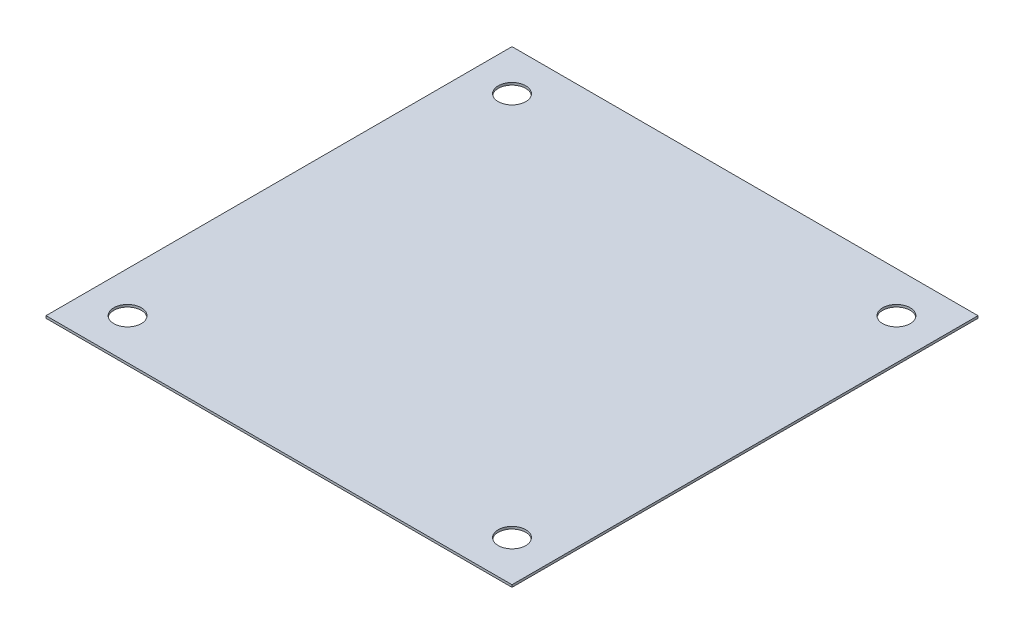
ISO-10303-21;
HEADER;
FILE_DESCRIPTION(('STEP AP214'),'2;1');
FILE_NAME('part.step','',(''),(''),'','','');
FILE_SCHEMA(('AUTOMOTIVE_DESIGN { 1 0 10303 214 1 1 1 1 }'));
ENDSEC;
DATA;
#1=APPLICATION_CONTEXT('core data for automotive mechanical design processes');
#2=APPLICATION_PROTOCOL_DEFINITION('international standard','automotive_design',2000,#1);
#3=PRODUCT_CONTEXT('',#1,'mechanical');
#4=PRODUCT('Part','Part','',(#3));
#5=PRODUCT_RELATED_PRODUCT_CATEGORY('part','',(#4));
#6=PRODUCT_DEFINITION_FORMATION('','',#4);
#7=PRODUCT_DEFINITION_CONTEXT('part definition',#1,'design');
#8=PRODUCT_DEFINITION('design','',#6,#7);
#9=PRODUCT_DEFINITION_SHAPE('','',#8);
#10=(LENGTH_UNIT() NAMED_UNIT(*) SI_UNIT(.MILLI.,.METRE.));
#11=(NAMED_UNIT(*) PLANE_ANGLE_UNIT() SI_UNIT($,.RADIAN.));
#12=(NAMED_UNIT(*) SI_UNIT($,.STERADIAN.) SOLID_ANGLE_UNIT());
#13=UNCERTAINTY_MEASURE_WITH_UNIT(LENGTH_MEASURE(1.E-05),#10,'distance_accuracy_value','');
#14=(GEOMETRIC_REPRESENTATION_CONTEXT(3) GLOBAL_UNCERTAINTY_ASSIGNED_CONTEXT((#13)) GLOBAL_UNIT_ASSIGNED_CONTEXT((#10,
#11,#12)) REPRESENTATION_CONTEXT('',''));
#15=CARTESIAN_POINT('',(0.,0.,0.));
#16=DIRECTION('',(0.,0.,1.));
#17=DIRECTION('',(1.,0.,0.));
#18=AXIS2_PLACEMENT_3D('',#15,#16,#17);
#19=CARTESIAN_POINT('',(-25.4,2.54,0.));
#20=DIRECTION('',(-1.,0.,0.));
#21=DIRECTION('',(0.,0.,1.));
#22=AXIS2_PLACEMENT_3D('',#19,#20,#21);
#23=PLANE('',#22);
#24=DIRECTION('',(0.,1.,0.));
#25=VECTOR('',#24,1.);
#26=CARTESIAN_POINT('',(-25.4,2.54,-25.4));
#27=LINE('',#26,#25);
#28=CARTESIAN_POINT('',(-25.4,2.413,-25.4));
#29=VERTEX_POINT('',#28);
#30=CARTESIAN_POINT('',(-25.4,2.667,-25.4));
#31=VERTEX_POINT('',#30);
#32=EDGE_CURVE('E11',#29,#31,#27,.T.);
#33=ORIENTED_EDGE('',*,*,#32,.F.);
#34=DIRECTION('',(0.,0.,1.));
#35=VECTOR('',#34,1.);
#36=CARTESIAN_POINT('',(-25.4,2.413,0.));
#37=LINE('',#36,#35);
#38=CARTESIAN_POINT('',(-25.4,2.413,25.4));
#39=VERTEX_POINT('',#38);
#40=EDGE_CURVE('E94',#39,#29,#37,.F.);
#41=ORIENTED_EDGE('',*,*,#40,.F.);
#42=DIRECTION('',(0.,1.,0.));
#43=VECTOR('',#42,1.);
#44=CARTESIAN_POINT('',(-25.4,2.54,25.4));
#45=LINE('',#44,#43);
#46=CARTESIAN_POINT('',(-25.4,2.667,25.4));
#47=VERTEX_POINT('',#46);
#48=EDGE_CURVE('E49',#39,#47,#45,.T.);
#49=ORIENTED_EDGE('',*,*,#48,.T.);
#50=DIRECTION('',(0.,0.,1.));
#51=VECTOR('',#50,1.);
#52=CARTESIAN_POINT('',(-25.4,2.667,0.));
#53=LINE('',#52,#51);
#54=EDGE_CURVE('E111',#47,#31,#53,.F.);
#55=ORIENTED_EDGE('',*,*,#54,.T.);
#56=EDGE_LOOP('',(#33,#41,#49,#55));
#57=FACE_BOUND('',#56,.T.);
#58=ADVANCED_FACE('F39',(#57),#23,.T.);
#59=CARTESIAN_POINT('',(0.,2.54,25.4));
#60=DIRECTION('',(0.,0.,1.));
#61=DIRECTION('',(1.,0.,0.));
#62=AXIS2_PLACEMENT_3D('',#59,#60,#61);
#63=PLANE('',#62);
#64=ORIENTED_EDGE('',*,*,#48,.F.);
#65=DIRECTION('',(1.,0.,0.));
#66=VECTOR('',#65,1.);
#67=CARTESIAN_POINT('',(0.,2.413,25.4));
#68=LINE('',#67,#66);
#69=CARTESIAN_POINT('',(25.4,2.413,25.4));
#70=VERTEX_POINT('',#69);
#71=EDGE_CURVE('E105',#70,#39,#68,.F.);
#72=ORIENTED_EDGE('',*,*,#71,.F.);
#73=DIRECTION('',(0.,1.,0.));
#74=VECTOR('',#73,1.);
#75=CARTESIAN_POINT('',(25.4,2.54,25.4));
#76=LINE('',#75,#74);
#77=CARTESIAN_POINT('',(25.4,2.667,25.4));
#78=VERTEX_POINT('',#77);
#79=EDGE_CURVE('E57',#70,#78,#76,.T.);
#80=ORIENTED_EDGE('',*,*,#79,.T.);
#81=DIRECTION('',(1.,0.,0.));
#82=VECTOR('',#81,1.);
#83=CARTESIAN_POINT('',(0.,2.667,25.4));
#84=LINE('',#83,#82);
#85=EDGE_CURVE('E88',#78,#47,#84,.F.);
#86=ORIENTED_EDGE('',*,*,#85,.T.);
#87=EDGE_LOOP('',(#64,#72,#80,#86));
#88=FACE_BOUND('',#87,.T.);
#89=ADVANCED_FACE('F115',(#88),#63,.T.);
#90=CARTESIAN_POINT('',(25.4,2.54,0.));
#91=DIRECTION('',(-1.,0.,0.));
#92=DIRECTION('',(0.,0.,1.));
#93=AXIS2_PLACEMENT_3D('',#90,#91,#92);
#94=PLANE('',#93);
#95=ORIENTED_EDGE('',*,*,#79,.F.);
#96=DIRECTION('',(0.,0.,1.));
#97=VECTOR('',#96,1.);
#98=CARTESIAN_POINT('',(25.4,2.413,0.));
#99=LINE('',#98,#97);
#100=CARTESIAN_POINT('',(25.4,2.413,-25.4));
#101=VERTEX_POINT('',#100);
#102=EDGE_CURVE('E93',#101,#70,#99,.T.);
#103=ORIENTED_EDGE('',*,*,#102,.F.);
#104=DIRECTION('',(0.,1.,0.));
#105=VECTOR('',#104,1.);
#106=CARTESIAN_POINT('',(25.4,2.54,-25.4));
#107=LINE('',#106,#105);
#108=CARTESIAN_POINT('',(25.4,2.667,-25.4));
#109=VERTEX_POINT('',#108);
#110=EDGE_CURVE('E43',#101,#109,#107,.T.);
#111=ORIENTED_EDGE('',*,*,#110,.T.);
#112=DIRECTION('',(0.,0.,1.));
#113=VECTOR('',#112,1.);
#114=CARTESIAN_POINT('',(25.4,2.667,0.));
#115=LINE('',#114,#113);
#116=EDGE_CURVE('E107',#109,#78,#115,.T.);
#117=ORIENTED_EDGE('',*,*,#116,.T.);
#118=EDGE_LOOP('',(#95,#103,#111,#117));
#119=FACE_BOUND('',#118,.T.);
#120=ADVANCED_FACE('F96',(#119),#94,.F.);
#121=CARTESIAN_POINT('',(0.,2.54,-25.4));
#122=DIRECTION('',(0.,0.,1.));
#123=DIRECTION('',(1.,0.,0.));
#124=AXIS2_PLACEMENT_3D('',#121,#122,#123);
#125=PLANE('',#124);
#126=DIRECTION('',(1.,0.,0.));
#127=VECTOR('',#126,1.);
#128=CARTESIAN_POINT('',(0.,2.413,-25.4));
#129=LINE('',#128,#127);
#130=EDGE_CURVE('E82',#29,#101,#129,.T.);
#131=ORIENTED_EDGE('',*,*,#130,.F.);
#132=ORIENTED_EDGE('',*,*,#32,.T.);
#133=DIRECTION('',(1.,0.,0.));
#134=VECTOR('',#133,1.);
#135=CARTESIAN_POINT('',(0.,2.667,-25.4));
#136=LINE('',#135,#134);
#137=EDGE_CURVE('E84',#31,#109,#136,.T.);
#138=ORIENTED_EDGE('',*,*,#137,.T.);
#139=ORIENTED_EDGE('',*,*,#110,.F.);
#140=EDGE_LOOP('',(#131,#132,#138,#139));
#141=FACE_BOUND('',#140,.T.);
#142=ADVANCED_FACE('F41',(#141),#125,.F.);
#143=CARTESIAN_POINT('',(0.,2.667,0.));
#144=DIRECTION('',(0.,1.,0.));
#145=DIRECTION('',(0.,0.,1.));
#146=AXIS2_PLACEMENT_3D('',#143,#144,#145);
#147=PLANE('',#146);
#148=CARTESIAN_POINT('',(20.955,2.667,20.955));
#149=DIRECTION('',(0.,1.,0.));
#150=DIRECTION('',(0.,0.,1.));
#151=AXIS2_PLACEMENT_3D('',#148,#149,#150);
#152=CIRCLE('',#151,1.49987);
#153=CARTESIAN_POINT('',(20.955,2.667,22.45487));
#154=VERTEX_POINT('',#153);
#155=EDGE_CURVE('E122',#154,#154,#152,.T.);
#156=ORIENTED_EDGE('',*,*,#155,.F.);
#157=EDGE_LOOP('',(#156));
#158=FACE_BOUND('',#157,.T.);
#159=CARTESIAN_POINT('',(-20.955,2.667,20.955));
#160=DIRECTION('',(0.,1.,0.));
#161=DIRECTION('',(0.,0.,1.));
#162=AXIS2_PLACEMENT_3D('',#159,#160,#161);
#163=CIRCLE('',#162,1.49987);
#164=CARTESIAN_POINT('',(-20.955,2.667,22.45487));
#165=VERTEX_POINT('',#164);
#166=EDGE_CURVE('E128',#165,#165,#163,.T.);
#167=ORIENTED_EDGE('',*,*,#166,.F.);
#168=EDGE_LOOP('',(#167));
#169=FACE_BOUND('',#168,.T.);
#170=CARTESIAN_POINT('',(-20.955,2.667,-20.955));
#171=DIRECTION('',(0.,1.,0.));
#172=DIRECTION('',(0.,0.,1.));
#173=AXIS2_PLACEMENT_3D('',#170,#171,#172);
#174=CIRCLE('',#173,1.49987);
#175=CARTESIAN_POINT('',(-20.955,2.667,-19.45513));
#176=VERTEX_POINT('',#175);
#177=EDGE_CURVE('E134',#176,#176,#174,.T.);
#178=ORIENTED_EDGE('',*,*,#177,.F.);
#179=EDGE_LOOP('',(#178));
#180=FACE_BOUND('',#179,.T.);
#181=CARTESIAN_POINT('',(20.955,2.667,-20.955));
#182=DIRECTION('',(0.,1.,0.));
#183=DIRECTION('',(0.,0.,1.));
#184=AXIS2_PLACEMENT_3D('',#181,#182,#183);
#185=CIRCLE('',#184,1.49987);
#186=CARTESIAN_POINT('',(20.955,2.667,-19.45513));
#187=VERTEX_POINT('',#186);
#188=EDGE_CURVE('E100',#187,#187,#185,.T.);
#189=ORIENTED_EDGE('',*,*,#188,.F.);
#190=EDGE_LOOP('',(#189));
#191=FACE_BOUND('',#190,.T.);
#192=ORIENTED_EDGE('',*,*,#116,.F.);
#193=ORIENTED_EDGE('',*,*,#137,.F.);
#194=ORIENTED_EDGE('',*,*,#54,.F.);
#195=ORIENTED_EDGE('',*,*,#85,.F.);
#196=EDGE_LOOP('',(#192,#193,#194,#195));
#197=FACE_BOUND('',#196,.T.);
#198=ADVANCED_FACE('F114',(#158,#169,#180,#191,#197),#147,.T.);
#199=CARTESIAN_POINT('',(0.,2.413,0.));
#200=DIRECTION('',(0.,1.,0.));
#201=DIRECTION('',(0.,0.,1.));
#202=AXIS2_PLACEMENT_3D('',#199,#200,#201);
#203=PLANE('',#202);
#204=CARTESIAN_POINT('',(20.955,2.413,20.955));
#205=DIRECTION('',(0.,1.,0.));
#206=DIRECTION('',(0.,0.,1.));
#207=AXIS2_PLACEMENT_3D('',#204,#205,#206);
#208=CIRCLE('',#207,1.49987);
#209=CARTESIAN_POINT('',(20.955,2.413,22.45487));
#210=VERTEX_POINT('',#209);
#211=EDGE_CURVE('E125',#210,#210,#208,.T.);
#212=ORIENTED_EDGE('',*,*,#211,.T.);
#213=EDGE_LOOP('',(#212));
#214=FACE_BOUND('',#213,.T.);
#215=CARTESIAN_POINT('',(-20.955,2.413,20.955));
#216=DIRECTION('',(0.,1.,0.));
#217=DIRECTION('',(0.,0.,1.));
#218=AXIS2_PLACEMENT_3D('',#215,#216,#217);
#219=CIRCLE('',#218,1.49987);
#220=CARTESIAN_POINT('',(-20.955,2.413,22.45487));
#221=VERTEX_POINT('',#220);
#222=EDGE_CURVE('E131',#221,#221,#219,.T.);
#223=ORIENTED_EDGE('',*,*,#222,.T.);
#224=EDGE_LOOP('',(#223));
#225=FACE_BOUND('',#224,.T.);
#226=CARTESIAN_POINT('',(-20.955,2.413,-20.955));
#227=DIRECTION('',(0.,1.,0.));
#228=DIRECTION('',(0.,0.,1.));
#229=AXIS2_PLACEMENT_3D('',#226,#227,#228);
#230=CIRCLE('',#229,1.49987);
#231=CARTESIAN_POINT('',(-20.955,2.413,-19.45513));
#232=VERTEX_POINT('',#231);
#233=EDGE_CURVE('E120',#232,#232,#230,.T.);
#234=ORIENTED_EDGE('',*,*,#233,.T.);
#235=EDGE_LOOP('',(#234));
#236=FACE_BOUND('',#235,.T.);
#237=CARTESIAN_POINT('',(20.955,2.413,-20.955));
#238=DIRECTION('',(0.,1.,0.));
#239=DIRECTION('',(0.,0.,1.));
#240=AXIS2_PLACEMENT_3D('',#237,#238,#239);
#241=CIRCLE('',#240,1.49987);
#242=CARTESIAN_POINT('',(20.955,2.413,-19.45513));
#243=VERTEX_POINT('',#242);
#244=EDGE_CURVE('E97',#243,#243,#241,.T.);
#245=ORIENTED_EDGE('',*,*,#244,.T.);
#246=EDGE_LOOP('',(#245));
#247=FACE_BOUND('',#246,.T.);
#248=ORIENTED_EDGE('',*,*,#102,.T.);
#249=ORIENTED_EDGE('',*,*,#71,.T.);
#250=ORIENTED_EDGE('',*,*,#40,.T.);
#251=ORIENTED_EDGE('',*,*,#130,.T.);
#252=EDGE_LOOP('',(#248,#249,#250,#251));
#253=FACE_BOUND('',#252,.T.);
#254=ADVANCED_FACE('F91',(#214,#225,#236,#247,#253),#203,.F.);
#255=CARTESIAN_POINT('',(20.955,2.413,-20.955));
#256=DIRECTION('',(0.,1.,0.));
#257=DIRECTION('',(0.,0.,1.));
#258=AXIS2_PLACEMENT_3D('',#255,#256,#257);
#259=CYLINDRICAL_SURFACE('',#258,1.49987);
#260=ORIENTED_EDGE('',*,*,#244,.F.);
#261=EDGE_LOOP('',(#260));
#262=FACE_BOUND('',#261,.T.);
#263=ORIENTED_EDGE('',*,*,#188,.T.);
#264=EDGE_LOOP('',(#263));
#265=FACE_BOUND('',#264,.T.);
#266=ADVANCED_FACE('F146',(#262,#265),#259,.F.);
#267=CARTESIAN_POINT('',(-20.955,2.413,-20.955));
#268=DIRECTION('',(0.,1.,0.));
#269=DIRECTION('',(0.,0.,1.));
#270=AXIS2_PLACEMENT_3D('',#267,#268,#269);
#271=CYLINDRICAL_SURFACE('',#270,1.49987);
#272=ORIENTED_EDGE('',*,*,#233,.F.);
#273=EDGE_LOOP('',(#272));
#274=FACE_BOUND('',#273,.T.);
#275=ORIENTED_EDGE('',*,*,#177,.T.);
#276=EDGE_LOOP('',(#275));
#277=FACE_BOUND('',#276,.T.);
#278=ADVANCED_FACE('F142',(#274,#277),#271,.F.);
#279=CARTESIAN_POINT('',(-20.955,2.413,20.955));
#280=DIRECTION('',(0.,1.,0.));
#281=DIRECTION('',(0.,0.,1.));
#282=AXIS2_PLACEMENT_3D('',#279,#280,#281);
#283=CYLINDRICAL_SURFACE('',#282,1.49987);
#284=ORIENTED_EDGE('',*,*,#222,.F.);
#285=EDGE_LOOP('',(#284));
#286=FACE_BOUND('',#285,.T.);
#287=ORIENTED_EDGE('',*,*,#166,.T.);
#288=EDGE_LOOP('',(#287));
#289=FACE_BOUND('',#288,.T.);
#290=ADVANCED_FACE('F145',(#286,#289),#283,.F.);
#291=CARTESIAN_POINT('',(20.955,2.413,20.955));
#292=DIRECTION('',(0.,1.,0.));
#293=DIRECTION('',(0.,0.,1.));
#294=AXIS2_PLACEMENT_3D('',#291,#292,#293);
#295=CYLINDRICAL_SURFACE('',#294,1.49987);
#296=ORIENTED_EDGE('',*,*,#211,.F.);
#297=EDGE_LOOP('',(#296));
#298=FACE_BOUND('',#297,.T.);
#299=ORIENTED_EDGE('',*,*,#155,.T.);
#300=EDGE_LOOP('',(#299));
#301=FACE_BOUND('',#300,.T.);
#302=ADVANCED_FACE('F206',(#298,#301),#295,.F.);
#303=CLOSED_SHELL('',(#58,#89,#120,#142,#198,#254,#266,#278,#290,#302));
#304=MANIFOLD_SOLID_BREP('B2',#303);
#305=ADVANCED_BREP_SHAPE_REPRESENTATION('',(#18,#304),#14);
#306=SHAPE_DEFINITION_REPRESENTATION(#9,#305);
ENDSEC;
END-ISO-10303-21;
